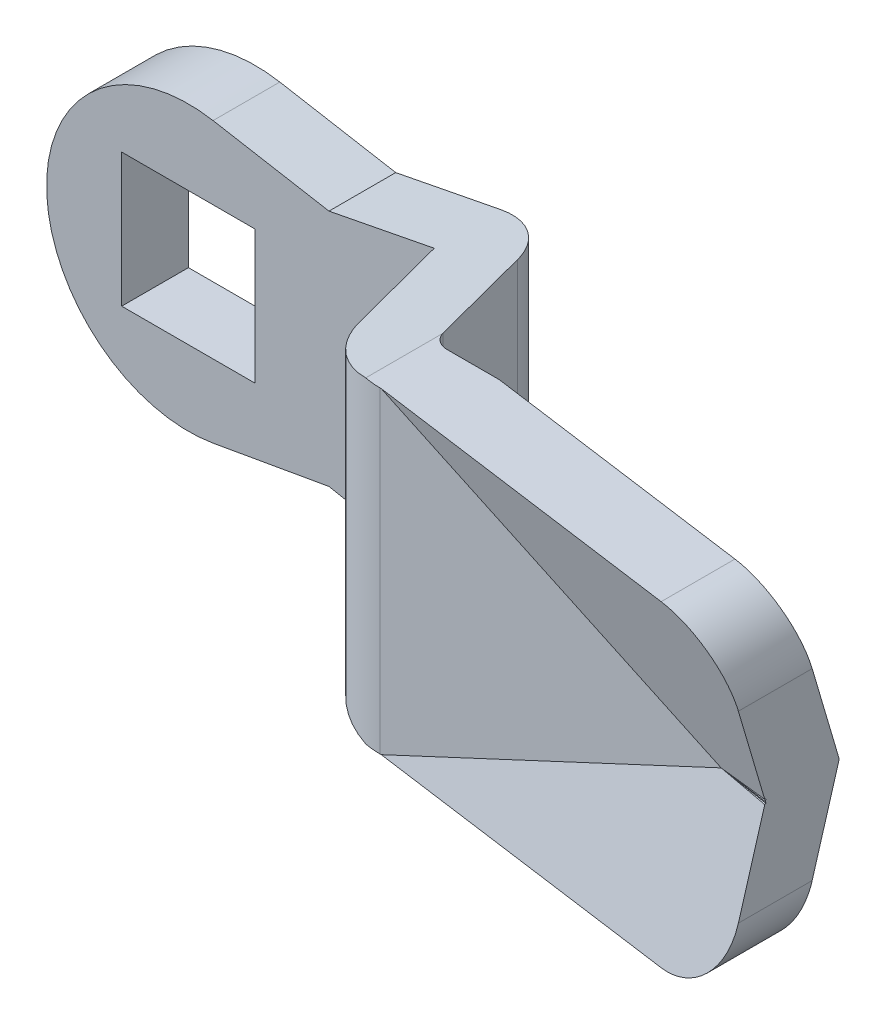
ISO-10303-21;
HEADER;
FILE_DESCRIPTION(('STEP AP214'),'2;1');
FILE_NAME('part.step','',(''),(''),'','','');
FILE_SCHEMA(('AUTOMOTIVE_DESIGN { 1 0 10303 214 1 1 1 1 }'));
ENDSEC;
DATA;
#1=APPLICATION_CONTEXT('core data for automotive mechanical design processes');
#2=APPLICATION_PROTOCOL_DEFINITION('international standard','automotive_design',2000,#1);
#3=PRODUCT_CONTEXT('',#1,'mechanical');
#4=PRODUCT('Part','Part','',(#3));
#5=PRODUCT_RELATED_PRODUCT_CATEGORY('part','',(#4));
#6=PRODUCT_DEFINITION_FORMATION('','',#4);
#7=PRODUCT_DEFINITION_CONTEXT('part definition',#1,'design');
#8=PRODUCT_DEFINITION('design','',#6,#7);
#9=PRODUCT_DEFINITION_SHAPE('','',#8);
#10=(LENGTH_UNIT() NAMED_UNIT(*) SI_UNIT(.MILLI.,.METRE.));
#11=(NAMED_UNIT(*) PLANE_ANGLE_UNIT() SI_UNIT($,.RADIAN.));
#12=(NAMED_UNIT(*) SI_UNIT($,.STERADIAN.) SOLID_ANGLE_UNIT());
#13=UNCERTAINTY_MEASURE_WITH_UNIT(LENGTH_MEASURE(1.E-05),#10,'distance_accuracy_value','');
#14=(GEOMETRIC_REPRESENTATION_CONTEXT(3) GLOBAL_UNCERTAINTY_ASSIGNED_CONTEXT((#13)) GLOBAL_UNIT_ASSIGNED_CONTEXT((#10,
#11,#12)) REPRESENTATION_CONTEXT('',''));
#15=CARTESIAN_POINT('',(0.,0.,0.));
#16=DIRECTION('',(0.,0.,1.));
#17=DIRECTION('',(1.,0.,0.));
#18=AXIS2_PLACEMENT_3D('',#15,#16,#17);
#19=CARTESIAN_POINT('',(49.9633750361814,-17.238998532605,20.1803398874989));
#20=DIRECTION('',(0.130596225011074,-0.280064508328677,-0.951056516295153));
#21=DIRECTION('',(0.,-0.959272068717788,0.28248380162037));
#22=AXIS2_PLACEMENT_3D('',#19,#20,#21);
#23=PLANE('',#22);
#24=DIRECTION('',(-0.990703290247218,0.,-0.13604040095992));
#25=VECTOR('',#24,1.);
#26=CARTESIAN_POINT('',(50.2705232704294,-9.5,17.9435575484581));
#27=LINE('',#26,#25);
#28=CARTESIAN_POINT('',(41.,-9.5,16.6705571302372));
#29=VERTEX_POINT('',#28);
#30=CARTESIAN_POINT('',(21.5518822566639,-9.5,14.));
#31=VERTEX_POINT('',#30);
#32=EDGE_CURVE('E378',#29,#31,#27,.T.);
#33=ORIENTED_EDGE('',*,*,#32,.F.);
#34=CARTESIAN_POINT('',(41.,-5.5,15.4926481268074));
#35=DIRECTION('',(0.130596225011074,-0.280064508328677,-0.951056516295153));
#36=DIRECTION('',(0.401933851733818,-0.861949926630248,0.309016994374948));
#37=AXIS2_PLACEMENT_3D('',#34,#35,#36);
#38=ELLIPSE('',#37,4.20584889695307,4.);
#39=CARTESIAN_POINT('',(45.,-5.5,16.0419161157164));
#40=VERTEX_POINT('',#39);
#41=EDGE_CURVE('E9',#29,#40,#38,.F.);
#42=ORIENTED_EDGE('',*,*,#41,.T.);
#43=DIRECTION('',(0.,0.959272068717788,-0.28248380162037));
#44=VECTOR('',#43,1.);
#45=CARTESIAN_POINT('',(45.,-17.4236857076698,19.5531703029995));
#46=LINE('',#45,#44);
#47=CARTESIAN_POINT('',(45.,-0.136162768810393,14.4623880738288));
#48=VERTEX_POINT('',#47);
#49=EDGE_CURVE('E372',#40,#48,#46,.T.);
#50=ORIENTED_EDGE('',*,*,#49,.T.);
#51=DIRECTION('',(0.987938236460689,-0.0437421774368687,0.148541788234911));
#52=VECTOR('',#51,1.);
#53=CARTESIAN_POINT('',(51.4225647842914,-0.420529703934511,15.4280549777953));
#54=LINE('',#53,#52);
#55=CARTESIAN_POINT('',(41.924698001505,0.,14.));
#56=VERTEX_POINT('',#55);
#57=EDGE_CURVE('E218',#56,#48,#54,.T.);
#58=ORIENTED_EDGE('',*,*,#57,.F.);
#59=DIRECTION('',(0.906307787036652,0.422618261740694,0.));
#60=VECTOR('',#59,1.);
#61=CARTESIAN_POINT('',(40.8120209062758,-0.518849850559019,14.));
#62=LINE('',#61,#60);
#63=EDGE_CURVE('E394',#56,#31,#62,.F.);
#64=ORIENTED_EDGE('',*,*,#63,.T.);
#65=EDGE_LOOP('',(#33,#42,#50,#58,#64));
#66=FACE_BOUND('',#65,.T.);
#67=ADVANCED_FACE('F14',(#66),#23,.F.);
#68=DIRECTION('',(-0.990703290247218,0.,-0.13604040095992));
#69=VECTOR('',#68,1.);
#70=CARTESIAN_POINT('',(50.6475627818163,0.,15.1977975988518));
#71=LINE('',#70,#69);
#72=CARTESIAN_POINT('',(45.,0.,14.4222912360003));
#73=VERTEX_POINT('',#72);
#74=EDGE_CURVE('E227',#73,#56,#71,.T.);
#75=ORIENTED_EDGE('',*,*,#74,.F.);
#76=CARTESIAN_POINT('',(45.,0.114431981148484,14.3885936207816));
#77=VERTEX_POINT('',#76);
#78=EDGE_CURVE('E234',#73,#77,#46,.T.);
#79=ORIENTED_EDGE('',*,*,#78,.T.);
#80=DIRECTION('',(0.991435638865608,0.0368913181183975,0.125277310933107));
#81=VECTOR('',#80,1.);
#82=CARTESIAN_POINT('',(41.924698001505,0.,14.));
#83=LINE('',#82,#81);
#84=EDGE_CURVE('E239',#56,#77,#83,.T.);
#85=ORIENTED_EDGE('',*,*,#84,.F.);
#86=EDGE_LOOP('',(#75,#79,#85));
#87=FACE_BOUND('',#86,.T.);
#88=ADVANCED_FACE('F536',(#87),#23,.F.);
#89=CARTESIAN_POINT('',(45.,-40.,40.));
#90=DIRECTION('',(-1.,0.,0.));
#91=DIRECTION('',(0.,1.,0.));
#92=AXIS2_PLACEMENT_3D('',#89,#90,#91);
#93=PLANE('',#92);
#94=DIRECTION('',(0.,-0.959272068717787,-0.282483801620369));
#95=VECTOR('',#94,1.);
#96=CARTESIAN_POINT('',(45.,11.3997764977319,13.3569748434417));
#97=LINE('',#96,#95);
#98=CARTESIAN_POINT('',(45.,5.5,11.6196248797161));
#99=VERTEX_POINT('',#98);
#100=CARTESIAN_POINT('',(45.,0.,10.));
#101=VERTEX_POINT('',#100);
#102=EDGE_CURVE('E374',#99,#101,#97,.T.);
#103=ORIENTED_EDGE('',*,*,#102,.F.);
#104=DIRECTION('',(0.,0.,-1.));
#105=VECTOR('',#104,1.);
#106=CARTESIAN_POINT('',(45.,5.5,40.));
#107=LINE('',#106,#105);
#108=CARTESIAN_POINT('',(45.,5.5,16.0419161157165));
#109=VERTEX_POINT('',#108);
#110=EDGE_CURVE('E458',#99,#109,#107,.F.);
#111=ORIENTED_EDGE('',*,*,#110,.T.);
#112=DIRECTION('',(0.,0.959272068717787,0.282483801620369));
#113=VECTOR('',#112,1.);
#114=CARTESIAN_POINT('',(45.,20.0272720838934,20.3198672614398));
#115=LINE('',#114,#113);
#116=CARTESIAN_POINT('',(45.,0.13616276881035,14.4623880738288));
#117=VERTEX_POINT('',#116);
#118=EDGE_CURVE('E369',#117,#109,#115,.T.);
#119=ORIENTED_EDGE('',*,*,#118,.F.);
#120=DIRECTION('',(0.,-0.28248380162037,-0.959272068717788));
#121=VECTOR('',#120,1.);
#122=CARTESIAN_POINT('',(45.,3.85356541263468,27.0861226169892));
#123=LINE('',#122,#121);
#124=EDGE_CURVE('E445',#117,#77,#123,.T.);
#125=ORIENTED_EDGE('',*,*,#124,.T.);
#126=ORIENTED_EDGE('',*,*,#78,.F.);
#127=DIRECTION('',(0.,0.959272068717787,0.28248380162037));
#128=VECTOR('',#127,1.);
#129=CARTESIAN_POINT('',(45.,-29.8770987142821,5.62416534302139));
#130=LINE('',#129,#128);
#131=CARTESIAN_POINT('',(45.,-0.114431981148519,14.3885936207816));
#132=VERTEX_POINT('',#131);
#133=EDGE_CURVE('E222',#132,#73,#130,.T.);
#134=ORIENTED_EDGE('',*,*,#133,.F.);
#135=DIRECTION('',(0.,0.282483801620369,-0.959272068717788));
#136=VECTOR('',#135,1.);
#137=CARTESIAN_POINT('',(45.,-10.2373332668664,48.7644282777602));
#138=LINE('',#137,#136);
#139=EDGE_CURVE('E212',#48,#132,#138,.T.);
#140=ORIENTED_EDGE('',*,*,#139,.F.);
#141=ORIENTED_EDGE('',*,*,#49,.F.);
#142=DIRECTION('',(0.,0.,-1.));
#143=VECTOR('',#142,1.);
#144=CARTESIAN_POINT('',(45.,-5.5,40.));
#145=LINE('',#144,#143);
#146=CARTESIAN_POINT('',(45.,-5.5,11.6196248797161));
#147=VERTEX_POINT('',#146);
#148=EDGE_CURVE('E455',#40,#147,#145,.T.);
#149=ORIENTED_EDGE('',*,*,#148,.T.);
#150=DIRECTION('',(0.,-0.959272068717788,0.28248380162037));
#151=VECTOR('',#150,1.);
#152=CARTESIAN_POINT('',(45.,-26.2800452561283,17.7388754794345));
#153=LINE('',#152,#151);
#154=EDGE_CURVE('E376',#101,#147,#153,.T.);
#155=ORIENTED_EDGE('',*,*,#154,.F.);
#156=EDGE_LOOP('',(#103,#111,#119,#125,#126,#134,#140,#141,#149,#155));
#157=FACE_BOUND('',#156,.T.);
#158=ADVANCED_FACE('F232',(#157),#93,.F.);
#159=CARTESIAN_POINT('',(41.2717168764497,1.40032254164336,18.7552825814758));
#160=DIRECTION('',(0.,0.959272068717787,-0.28248380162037));
#161=DIRECTION('',(0.,-0.28248380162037,-0.959272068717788));
#162=AXIS2_PLACEMENT_3D('',#159,#160,#161);
#163=PLANE('',#162);
#164=DIRECTION('',(0.987938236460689,0.0437421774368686,0.148541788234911));
#165=VECTOR('',#164,1.);
#166=CARTESIAN_POINT('',(42.0457266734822,0.00535869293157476,14.018197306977));
#167=LINE('',#166,#165);
#168=EDGE_CURVE('E447',#56,#117,#167,.T.);
#169=ORIENTED_EDGE('',*,*,#168,.F.);
#170=ORIENTED_EDGE('',*,*,#84,.T.);
#171=ORIENTED_EDGE('',*,*,#124,.F.);
#172=EDGE_LOOP('',(#169,#170,#171));
#173=FACE_BOUND('',#172,.T.);
#174=ADVANCED_FACE('F534',(#173),#163,.F.);
#175=CARTESIAN_POINT('',(10.5,-2.8,-2.4));
#176=DIRECTION('',(1.,0.,0.));
#177=DIRECTION('',(0.,0.,1.));
#178=AXIS2_PLACEMENT_3D('',#175,#176,#177);
#179=PLANE('',#178);
#180=DIRECTION('',(0.,0.,1.));
#181=VECTOR('',#180,1.);
#182=CARTESIAN_POINT('',(10.5,-2.8,-2.4));
#183=LINE('',#182,#181);
#184=CARTESIAN_POINT('',(10.5,-2.8,-0.400000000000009));
#185=VERTEX_POINT('',#184);
#186=CARTESIAN_POINT('',(10.5,-2.8,0.));
#187=VERTEX_POINT('',#186);
#188=EDGE_CURVE('E279',#185,#187,#183,.T.);
#189=ORIENTED_EDGE('',*,*,#188,.F.);
#190=DIRECTION('',(0.,-1.,0.));
#191=VECTOR('',#190,1.);
#192=CARTESIAN_POINT('',(10.5,9.5,-0.400000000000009));
#193=LINE('',#192,#191);
#194=CARTESIAN_POINT('',(10.5,2.8,-0.400000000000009));
#195=VERTEX_POINT('',#194);
#196=EDGE_CURVE('E245',#195,#185,#193,.T.);
#197=ORIENTED_EDGE('',*,*,#196,.F.);
#198=DIRECTION('',(0.,0.,1.));
#199=VECTOR('',#198,1.);
#200=CARTESIAN_POINT('',(10.5,2.8,-2.4));
#201=LINE('',#200,#199);
#202=CARTESIAN_POINT('',(10.5,2.8,0.));
#203=VERTEX_POINT('',#202);
#204=EDGE_CURVE('E271',#195,#203,#201,.T.);
#205=ORIENTED_EDGE('',*,*,#204,.T.);
#206=DIRECTION('',(0.,1.,0.));
#207=VECTOR('',#206,1.);
#208=CARTESIAN_POINT('',(10.5,-2.8,0.));
#209=LINE('',#208,#207);
#210=EDGE_CURVE('E252',#187,#203,#209,.T.);
#211=ORIENTED_EDGE('',*,*,#210,.F.);
#212=EDGE_LOOP('',(#189,#197,#205,#211));
#213=FACE_BOUND('',#212,.T.);
#214=ADVANCED_FACE('F795',(#213),#179,.T.);
#215=CARTESIAN_POINT('',(10.5,-2.8,-2.4));
#216=DIRECTION('',(0.,1.,0.));
#217=DIRECTION('',(1.,0.,0.));
#218=AXIS2_PLACEMENT_3D('',#215,#216,#217);
#219=PLANE('',#218);
#220=DIRECTION('',(0.707106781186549,0.,0.707106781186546));
#221=VECTOR('',#220,1.);
#222=CARTESIAN_POINT('',(8.5,-2.8,-2.4));
#223=LINE('',#222,#221);
#224=CARTESIAN_POINT('',(8.5,-2.8,-2.4));
#225=VERTEX_POINT('',#224);
#226=EDGE_CURVE('E242',#225,#185,#223,.T.);
#227=ORIENTED_EDGE('',*,*,#226,.T.);
#228=ORIENTED_EDGE('',*,*,#188,.T.);
#229=DIRECTION('',(-1.,0.,0.));
#230=VECTOR('',#229,1.);
#231=CARTESIAN_POINT('',(10.5,-2.8,0.));
#232=LINE('',#231,#230);
#233=CARTESIAN_POINT('',(6.5,-2.8,0.));
#234=VERTEX_POINT('',#233);
#235=EDGE_CURVE('E260',#187,#234,#232,.T.);
#236=ORIENTED_EDGE('',*,*,#235,.T.);
#237=DIRECTION('',(0.,0.,1.));
#238=VECTOR('',#237,1.);
#239=CARTESIAN_POINT('',(6.5,-2.8,-2.4));
#240=LINE('',#239,#238);
#241=CARTESIAN_POINT('',(6.5,-2.8,-2.4));
#242=VERTEX_POINT('',#241);
#243=EDGE_CURVE('E276',#242,#234,#240,.T.);
#244=ORIENTED_EDGE('',*,*,#243,.F.);
#245=DIRECTION('',(-1.,0.,0.));
#246=VECTOR('',#245,1.);
#247=CARTESIAN_POINT('',(10.5,-2.8,-2.4));
#248=LINE('',#247,#246);
#249=EDGE_CURVE('E269',#225,#242,#248,.T.);
#250=ORIENTED_EDGE('',*,*,#249,.F.);
#251=EDGE_LOOP('',(#227,#228,#236,#244,#250));
#252=FACE_BOUND('',#251,.T.);
#253=ADVANCED_FACE('F785',(#252),#219,.F.);
#254=CARTESIAN_POINT('',(6.5,2.8,-2.4));
#255=DIRECTION('',(0.,-1.,0.));
#256=DIRECTION('',(-1.,0.,0.));
#257=AXIS2_PLACEMENT_3D('',#254,#255,#256);
#258=PLANE('',#257);
#259=DIRECTION('',(0.707106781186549,0.,0.707106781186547));
#260=VECTOR('',#259,1.);
#261=CARTESIAN_POINT('',(7.5,2.8,-3.4));
#262=LINE('',#261,#260);
#263=CARTESIAN_POINT('',(8.5,2.8,-2.4));
#264=VERTEX_POINT('',#263);
#265=EDGE_CURVE('E250',#264,#195,#262,.T.);
#266=ORIENTED_EDGE('',*,*,#265,.F.);
#267=DIRECTION('',(1.,0.,0.));
#268=VECTOR('',#267,1.);
#269=CARTESIAN_POINT('',(6.5,2.8,-2.4));
#270=LINE('',#269,#268);
#271=CARTESIAN_POINT('',(6.5,2.8,-2.4));
#272=VERTEX_POINT('',#271);
#273=EDGE_CURVE('E263',#272,#264,#270,.T.);
#274=ORIENTED_EDGE('',*,*,#273,.F.);
#275=DIRECTION('',(0.,0.,1.));
#276=VECTOR('',#275,1.);
#277=CARTESIAN_POINT('',(6.5,2.8,-2.4));
#278=LINE('',#277,#276);
#279=CARTESIAN_POINT('',(6.5,2.8,0.));
#280=VERTEX_POINT('',#279);
#281=EDGE_CURVE('E273',#272,#280,#278,.T.);
#282=ORIENTED_EDGE('',*,*,#281,.T.);
#283=DIRECTION('',(1.,0.,0.));
#284=VECTOR('',#283,1.);
#285=CARTESIAN_POINT('',(6.5,2.8,0.));
#286=LINE('',#285,#284);
#287=EDGE_CURVE('E255',#280,#203,#286,.T.);
#288=ORIENTED_EDGE('',*,*,#287,.T.);
#289=ORIENTED_EDGE('',*,*,#204,.F.);
#290=EDGE_LOOP('',(#266,#274,#282,#288,#289));
#291=FACE_BOUND('',#290,.T.);
#292=ADVANCED_FACE('F774',(#291),#258,.F.);
#293=CARTESIAN_POINT('',(10.5,2.8,-2.4));
#294=DIRECTION('',(0.,0.,-1.));
#295=DIRECTION('',(1.,0.,0.));
#296=AXIS2_PLACEMENT_3D('',#293,#294,#295);
#297=PLANE('',#296);
#298=ORIENTED_EDGE('',*,*,#273,.T.);
#299=DIRECTION('',(0.,-1.,0.));
#300=VECTOR('',#299,1.);
#301=CARTESIAN_POINT('',(8.5,9.5,-2.4));
#302=LINE('',#301,#300);
#303=EDGE_CURVE('E247',#264,#225,#302,.T.);
#304=ORIENTED_EDGE('',*,*,#303,.T.);
#305=ORIENTED_EDGE('',*,*,#249,.T.);
#306=DIRECTION('',(0.,-1.,0.));
#307=VECTOR('',#306,1.);
#308=CARTESIAN_POINT('',(6.5,2.8,-2.4));
#309=LINE('',#308,#307);
#310=EDGE_CURVE('E266',#272,#242,#309,.T.);
#311=ORIENTED_EDGE('',*,*,#310,.F.);
#312=EDGE_LOOP('',(#298,#304,#305,#311));
#313=FACE_BOUND('',#312,.T.);
#314=ADVANCED_FACE('F565',(#313),#297,.T.);
#315=CARTESIAN_POINT('',(14.7328488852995,-9.5,0.));
#316=DIRECTION('',(0.,0.,-1.));
#317=DIRECTION('',(1.,0.,0.));
#318=AXIS2_PLACEMENT_3D('',#315,#316,#317);
#319=PLANE('',#318);
#320=DIRECTION('',(0.,1.,0.));
#321=VECTOR('',#320,1.);
#322=CARTESIAN_POINT('',(14.7328488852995,-9.5,0.));
#323=LINE('',#322,#321);
#324=CARTESIAN_POINT('',(14.7328488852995,-8.37243725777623,0.));
#325=VERTEX_POINT('',#324);
#326=CARTESIAN_POINT('',(14.7328488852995,8.37243725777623,0.));
#327=VERTEX_POINT('',#326);
#328=EDGE_CURVE('E426',#325,#327,#323,.T.);
#329=ORIENTED_EDGE('',*,*,#328,.F.);
#330=DIRECTION('',(-0.981627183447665,0.190808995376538,0.));
#331=VECTOR('',#330,1.);
#332=CARTESIAN_POINT('',(14.944045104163,-8.41348964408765,0.));
#333=LINE('',#332,#331);
#334=CARTESIAN_POINT('',(8.42299234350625,-7.14592539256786,0.));
#335=VERTEX_POINT('',#334);
#336=EDGE_CURVE('E319',#325,#335,#333,.T.);
#337=ORIENTED_EDGE('',*,*,#336,.T.);
#338=DIRECTION('',(0.984807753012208,0.173648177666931,0.));
#339=VECTOR('',#338,1.);
#340=CARTESIAN_POINT('',(14.1400129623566,-6.13786040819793,0.));
#341=LINE('',#340,#339);
#342=CARTESIAN_POINT('',(1.47600951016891,-8.37086590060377,0.));
#343=VERTEX_POINT('',#342);
#344=EDGE_CURVE('E443',#343,#335,#341,.T.);
#345=ORIENTED_EDGE('',*,*,#344,.F.);
#346=CARTESIAN_POINT('',(0.,0.,0.));
#347=DIRECTION('',(0.,0.,-1.));
#348=DIRECTION('',(1.,0.,0.));
#349=AXIS2_PLACEMENT_3D('',#346,#347,#348);
#350=CIRCLE('',#349,8.5);
#351=CARTESIAN_POINT('',(1.47600951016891,8.37086590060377,0.));
#352=VERTEX_POINT('',#351);
#353=EDGE_CURVE('E328',#343,#352,#350,.T.);
#354=ORIENTED_EDGE('',*,*,#353,.T.);
#355=DIRECTION('',(0.984807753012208,-0.173648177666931,0.));
#356=VECTOR('',#355,1.);
#357=CARTESIAN_POINT('',(17.3892043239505,5.56494030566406,0.));
#358=LINE('',#357,#356);
#359=CARTESIAN_POINT('',(8.42299234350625,7.14592539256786,0.));
#360=VERTEX_POINT('',#359);
#361=EDGE_CURVE('E440',#352,#360,#358,.T.);
#362=ORIENTED_EDGE('',*,*,#361,.T.);
#363=DIRECTION('',(-0.981627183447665,-0.190808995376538,0.));
#364=VECTOR('',#363,1.);
#365=CARTESIAN_POINT('',(11.385282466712,7.72173626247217,0.));
#366=LINE('',#365,#364);
#367=EDGE_CURVE('E302',#327,#360,#366,.T.);
#368=ORIENTED_EDGE('',*,*,#367,.F.);
#369=EDGE_LOOP('',(#329,#337,#345,#354,#362,#368));
#370=FACE_BOUND('',#369,.T.);
#371=DIRECTION('',(1.,0.,0.));
#372=VECTOR('',#371,1.);
#373=CARTESIAN_POINT('',(-4.,4.,0.));
#374=LINE('',#373,#372);
#375=CARTESIAN_POINT('',(-4.,4.,0.));
#376=VERTEX_POINT('',#375);
#377=CARTESIAN_POINT('',(4.,4.,0.));
#378=VERTEX_POINT('',#377);
#379=EDGE_CURVE('E346',#376,#378,#374,.T.);
#380=ORIENTED_EDGE('',*,*,#379,.F.);
#381=DIRECTION('',(0.,-1.,0.));
#382=VECTOR('',#381,1.);
#383=CARTESIAN_POINT('',(-4.,4.,0.));
#384=LINE('',#383,#382);
#385=CARTESIAN_POINT('',(-4.,-4.,0.));
#386=VERTEX_POINT('',#385);
#387=EDGE_CURVE('E337',#376,#386,#384,.T.);
#388=ORIENTED_EDGE('',*,*,#387,.T.);
#389=DIRECTION('',(-1.,0.,0.));
#390=VECTOR('',#389,1.);
#391=CARTESIAN_POINT('',(4.,-4.,0.));
#392=LINE('',#391,#390);
#393=CARTESIAN_POINT('',(4.,-4.,0.));
#394=VERTEX_POINT('',#393);
#395=EDGE_CURVE('E340',#394,#386,#392,.T.);
#396=ORIENTED_EDGE('',*,*,#395,.F.);
#397=DIRECTION('',(0.,1.,0.));
#398=VECTOR('',#397,1.);
#399=CARTESIAN_POINT('',(4.,-4.,0.));
#400=LINE('',#399,#398);
#401=EDGE_CURVE('E343',#394,#378,#400,.T.);
#402=ORIENTED_EDGE('',*,*,#401,.T.);
#403=EDGE_LOOP('',(#380,#388,#396,#402));
#404=FACE_BOUND('',#403,.T.);
#405=ORIENTED_EDGE('',*,*,#235,.F.);
#406=ORIENTED_EDGE('',*,*,#210,.T.);
#407=ORIENTED_EDGE('',*,*,#287,.F.);
#408=DIRECTION('',(0.,-1.,0.));
#409=VECTOR('',#408,1.);
#410=CARTESIAN_POINT('',(6.5,2.8,0.));
#411=LINE('',#410,#409);
#412=EDGE_CURVE('E258',#280,#234,#411,.T.);
#413=ORIENTED_EDGE('',*,*,#412,.T.);
#414=EDGE_LOOP('',(#405,#406,#407,#413));
#415=FACE_BOUND('',#414,.T.);
#416=ADVANCED_FACE('F505',(#370,#404,#415),#319,.T.);
#417=CARTESIAN_POINT('',(14.7328488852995,-9.5,4.));
#418=DIRECTION('',(0.,0.,-1.));
#419=DIRECTION('',(1.,0.,0.));
#420=AXIS2_PLACEMENT_3D('',#417,#418,#419);
#421=PLANE('',#420);
#422=DIRECTION('',(0.,-1.,0.));
#423=VECTOR('',#422,1.);
#424=CARTESIAN_POINT('',(-4.,-9.5,4.));
#425=LINE('',#424,#423);
#426=CARTESIAN_POINT('',(-4.,4.,4.));
#427=VERTEX_POINT('',#426);
#428=CARTESIAN_POINT('',(-4.,-4.,4.));
#429=VERTEX_POINT('',#428);
#430=EDGE_CURVE('E367',#427,#429,#425,.T.);
#431=ORIENTED_EDGE('',*,*,#430,.F.);
#432=DIRECTION('',(1.,0.,0.));
#433=VECTOR('',#432,1.);
#434=CARTESIAN_POINT('',(14.7328488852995,4.,4.));
#435=LINE('',#434,#433);
#436=CARTESIAN_POINT('',(4.,4.,4.));
#437=VERTEX_POINT('',#436);
#438=EDGE_CURVE('E358',#427,#437,#435,.T.);
#439=ORIENTED_EDGE('',*,*,#438,.T.);
#440=DIRECTION('',(0.,1.,0.));
#441=VECTOR('',#440,1.);
#442=CARTESIAN_POINT('',(4.,-9.5,4.));
#443=LINE('',#442,#441);
#444=CARTESIAN_POINT('',(4.,-4.,4.));
#445=VERTEX_POINT('',#444);
#446=EDGE_CURVE('E361',#445,#437,#443,.T.);
#447=ORIENTED_EDGE('',*,*,#446,.F.);
#448=DIRECTION('',(-1.,0.,0.));
#449=VECTOR('',#448,1.);
#450=CARTESIAN_POINT('',(14.7328488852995,-4.,4.));
#451=LINE('',#450,#449);
#452=EDGE_CURVE('E364',#445,#429,#451,.T.);
#453=ORIENTED_EDGE('',*,*,#452,.T.);
#454=EDGE_LOOP('',(#431,#439,#447,#453));
#455=FACE_BOUND('',#454,.T.);
#456=DIRECTION('',(-0.981627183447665,0.190808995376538,0.));
#457=VECTOR('',#456,1.);
#458=CARTESIAN_POINT('',(14.944045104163,-8.41348964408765,4.));
#459=LINE('',#458,#457);
#460=CARTESIAN_POINT('',(14.7328488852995,-8.37243725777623,4.));
#461=VERTEX_POINT('',#460);
#462=CARTESIAN_POINT('',(8.42299234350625,-7.14592539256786,4.));
#463=VERTEX_POINT('',#462);
#464=EDGE_CURVE('E326',#461,#463,#459,.T.);
#465=ORIENTED_EDGE('',*,*,#464,.F.);
#466=DIRECTION('',(0.,1.,0.));
#467=VECTOR('',#466,1.);
#468=CARTESIAN_POINT('',(14.7328488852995,-9.5,4.));
#469=LINE('',#468,#467);
#470=CARTESIAN_POINT('',(14.7328488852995,8.37243725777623,4.));
#471=VERTEX_POINT('',#470);
#472=EDGE_CURVE('E429',#461,#471,#469,.T.);
#473=ORIENTED_EDGE('',*,*,#472,.T.);
#474=DIRECTION('',(-0.981627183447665,-0.190808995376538,0.));
#475=VECTOR('',#474,1.);
#476=CARTESIAN_POINT('',(11.385282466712,7.72173626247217,4.));
#477=LINE('',#476,#475);
#478=CARTESIAN_POINT('',(8.42299234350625,7.14592539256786,4.));
#479=VERTEX_POINT('',#478);
#480=EDGE_CURVE('E310',#471,#479,#477,.T.);
#481=ORIENTED_EDGE('',*,*,#480,.T.);
#482=DIRECTION('',(0.984807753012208,-0.173648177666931,0.));
#483=VECTOR('',#482,1.);
#484=CARTESIAN_POINT('',(17.3892043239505,5.56494030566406,4.));
#485=LINE('',#484,#483);
#486=CARTESIAN_POINT('',(1.47600951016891,8.37086590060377,4.));
#487=VERTEX_POINT('',#486);
#488=EDGE_CURVE('E332',#487,#479,#485,.T.);
#489=ORIENTED_EDGE('',*,*,#488,.F.);
#490=CARTESIAN_POINT('',(0.,0.,4.));
#491=DIRECTION('',(0.,0.,-1.));
#492=DIRECTION('',(1.,0.,0.));
#493=AXIS2_PLACEMENT_3D('',#490,#491,#492);
#494=CIRCLE('',#493,8.5);
#495=CARTESIAN_POINT('',(1.47600951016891,-8.37086590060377,4.));
#496=VERTEX_POINT('',#495);
#497=EDGE_CURVE('E330',#496,#487,#494,.T.);
#498=ORIENTED_EDGE('',*,*,#497,.F.);
#499=DIRECTION('',(0.984807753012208,0.173648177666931,0.));
#500=VECTOR('',#499,1.);
#501=CARTESIAN_POINT('',(14.1400129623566,-6.13786040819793,4.));
#502=LINE('',#501,#500);
#503=EDGE_CURVE('E334',#496,#463,#502,.T.);
#504=ORIENTED_EDGE('',*,*,#503,.T.);
#505=EDGE_LOOP('',(#465,#473,#481,#489,#498,#504));
#506=FACE_BOUND('',#505,.T.);
#507=ADVANCED_FACE('F517',(#455,#506),#421,.F.);
#508=CARTESIAN_POINT('',(21.4899610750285,-9.5,9.));
#509=DIRECTION('',(0.,-1.,0.));
#510=DIRECTION('',(-1.,0.,0.));
#511=AXIS2_PLACEMENT_3D('',#508,#509,#510);
#512=PLANE('',#511);
#513=DIRECTION('',(0.990703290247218,0.,0.13604040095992));
#514=VECTOR('',#513,1.);
#515=CARTESIAN_POINT('',(33.3500490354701,-9.5,11.1977975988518));
#516=LINE('',#515,#514);
#517=CARTESIAN_POINT('',(24.6271842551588,-9.5,10.));
#518=VERTEX_POINT('',#517);
#519=CARTESIAN_POINT('',(41.,-9.5,12.2482658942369));
#520=VERTEX_POINT('',#519);
#521=EDGE_CURVE('E438',#518,#520,#516,.T.);
#522=ORIENTED_EDGE('',*,*,#521,.T.);
#523=DIRECTION('',(0.,0.,-1.));
#524=VECTOR('',#523,1.);
#525=CARTESIAN_POINT('',(41.,-9.5,40.));
#526=LINE('',#525,#524);
#527=EDGE_CURVE('E22',#520,#29,#526,.F.);
#528=ORIENTED_EDGE('',*,*,#527,.T.);
#529=ORIENTED_EDGE('',*,*,#32,.T.);
#530=DIRECTION('',(-1.,0.,0.));
#531=VECTOR('',#530,1.);
#532=CARTESIAN_POINT('',(45.,-9.5,14.));
#533=LINE('',#532,#531);
#534=CARTESIAN_POINT('',(21.4899610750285,-9.5,14.));
#535=VERTEX_POINT('',#534);
#536=EDGE_CURVE('E415',#31,#535,#533,.T.);
#537=ORIENTED_EDGE('',*,*,#536,.T.);
#538=CARTESIAN_POINT('',(21.4899610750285,-9.5,9.));
#539=DIRECTION('',(0.,-1.,0.));
#540=DIRECTION('',(-1.,0.,0.));
#541=AXIS2_PLACEMENT_3D('',#538,#539,#540);
#542=CIRCLE('',#541,5.);
#543=CARTESIAN_POINT('',(20.5336563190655,-9.5,13.90769612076));
#544=VERTEX_POINT('',#543);
#545=EDGE_CURVE('E412',#535,#544,#542,.T.);
#546=ORIENTED_EDGE('',*,*,#545,.T.);
#547=DIRECTION('',(0.,0.,-1.));
#548=VECTOR('',#547,1.);
#549=CARTESIAN_POINT('',(20.5336563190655,-9.5,25.));
#550=LINE('',#549,#548);
#551=CARTESIAN_POINT('',(20.5336563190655,-9.5,9.29237170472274));
#552=VERTEX_POINT('',#551);
#553=EDGE_CURVE('E295',#544,#552,#550,.T.);
#554=ORIENTED_EDGE('',*,*,#553,.T.);
#555=CARTESIAN_POINT('',(21.4899610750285,-9.5,9.));
#556=DIRECTION('',(0.,-1.,0.));
#557=DIRECTION('',(-1.,0.,0.));
#558=AXIS2_PLACEMENT_3D('',#555,#556,#557);
#559=CIRCLE('',#558,1.);
#560=CARTESIAN_POINT('',(21.4899610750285,-9.5,10.));
#561=VERTEX_POINT('',#560);
#562=EDGE_CURVE('E409',#561,#552,#559,.T.);
#563=ORIENTED_EDGE('',*,*,#562,.F.);
#564=DIRECTION('',(-1.,0.,0.));
#565=VECTOR('',#564,1.);
#566=CARTESIAN_POINT('',(45.,-9.5,10.));
#567=LINE('',#566,#565);
#568=EDGE_CURVE('E407',#518,#561,#567,.T.);
#569=ORIENTED_EDGE('',*,*,#568,.F.);
#570=EDGE_LOOP('',(#522,#528,#529,#537,#546,#554,#563,#569));
#571=FACE_BOUND('',#570,.T.);
#572=ADVANCED_FACE('F552',(#571),#512,.T.);
#573=CARTESIAN_POINT('',(21.4899610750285,-9.5,9.));
#574=DIRECTION('',(0.,1.,0.));
#575=DIRECTION('',(1.,0.,0.));
#576=AXIS2_PLACEMENT_3D('',#573,#574,#575);
#577=CYLINDRICAL_SURFACE('',#576,5.);
#578=CARTESIAN_POINT('',(21.4899610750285,-9.68588681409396,9.));
#579=DIRECTION('',(-0.190808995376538,-0.981627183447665,0.));
#580=DIRECTION('',(-0.981627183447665,0.190808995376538,0.));
#581=AXIS2_PLACEMENT_3D('',#578,#579,#580);
#582=ELLIPSE('',#581,5.09358347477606,5.);
#583=CARTESIAN_POINT('',(16.7084372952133,-8.75645274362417,10.4618585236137));
#584=VERTEX_POINT('',#583);
#585=EDGE_CURVE('E324',#544,#584,#582,.T.);
#586=ORIENTED_EDGE('',*,*,#585,.F.);
#587=ORIENTED_EDGE('',*,*,#545,.F.);
#588=DIRECTION('',(0.,1.,0.));
#589=VECTOR('',#588,1.);
#590=CARTESIAN_POINT('',(21.4899610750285,-9.5,14.));
#591=LINE('',#590,#589);
#592=CARTESIAN_POINT('',(21.4899610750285,9.5,14.));
#593=VERTEX_POINT('',#592);
#594=EDGE_CURVE('E435',#535,#593,#591,.T.);
#595=ORIENTED_EDGE('',*,*,#594,.T.);
#596=CARTESIAN_POINT('',(21.4899610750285,9.5,9.));
#597=DIRECTION('',(0.,-1.,0.));
#598=DIRECTION('',(-1.,0.,0.));
#599=AXIS2_PLACEMENT_3D('',#596,#597,#598);
#600=CIRCLE('',#599,5.);
#601=CARTESIAN_POINT('',(20.5336563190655,9.5,13.90769612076));
#602=VERTEX_POINT('',#601);
#603=EDGE_CURVE('E402',#593,#602,#600,.T.);
#604=ORIENTED_EDGE('',*,*,#603,.T.);
#605=CARTESIAN_POINT('',(21.4899610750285,9.68588681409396,9.));
#606=DIRECTION('',(0.190808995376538,-0.981627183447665,0.));
#607=DIRECTION('',(0.981627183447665,0.190808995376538,0.));
#608=AXIS2_PLACEMENT_3D('',#605,#606,#607);
#609=ELLIPSE('',#608,5.09358347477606,5.);
#610=CARTESIAN_POINT('',(16.7084372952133,8.75645274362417,10.4618585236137));
#611=VERTEX_POINT('',#610);
#612=EDGE_CURVE('E307',#602,#611,#609,.T.);
#613=ORIENTED_EDGE('',*,*,#612,.T.);
#614=DIRECTION('',(0.,1.,0.));
#615=VECTOR('',#614,1.);
#616=CARTESIAN_POINT('',(16.7084372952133,-9.5,10.4618585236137));
#617=LINE('',#616,#615);
#618=EDGE_CURVE('E432',#584,#611,#617,.T.);
#619=ORIENTED_EDGE('',*,*,#618,.F.);
#620=EDGE_LOOP('',(#586,#587,#595,#604,#613,#619));
#621=FACE_BOUND('',#620,.T.);
#622=ADVANCED_FACE('F525',(#621),#577,.T.);
#623=CARTESIAN_POINT('',(16.7084372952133,-9.5,10.4618585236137));
#624=DIRECTION('',(0.956304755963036,0.,-0.292371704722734));
#625=DIRECTION('',(0.292371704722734,0.,0.956304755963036));
#626=AXIS2_PLACEMENT_3D('',#623,#624,#625);
#627=PLANE('',#626);
#628=DIRECTION('',(-0.291900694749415,0.0567397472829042,-0.954764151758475));
#629=VECTOR('',#628,1.);
#630=CARTESIAN_POINT('',(16.7207522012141,-8.7588465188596,10.5021387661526));
#631=LINE('',#630,#629);
#632=EDGE_CURVE('E322',#584,#461,#631,.T.);
#633=ORIENTED_EDGE('',*,*,#632,.F.);
#634=ORIENTED_EDGE('',*,*,#618,.T.);
#635=DIRECTION('',(-0.291900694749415,-0.0567397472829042,-0.954764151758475));
#636=VECTOR('',#635,1.);
#637=CARTESIAN_POINT('',(16.4060671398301,8.69767793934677,9.47285030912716));
#638=LINE('',#637,#636);
#639=EDGE_CURVE('E304',#611,#471,#638,.T.);
#640=ORIENTED_EDGE('',*,*,#639,.T.);
#641=ORIENTED_EDGE('',*,*,#472,.F.);
#642=EDGE_LOOP('',(#633,#634,#640,#641));
#643=FACE_BOUND('',#642,.T.);
#644=ADVANCED_FACE('F521',(#643),#627,.F.);
#645=CARTESIAN_POINT('',(14.7328488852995,-9.5,4.));
#646=DIRECTION('',(0.,1.,0.));
#647=DIRECTION('',(1.,0.,0.));
#648=AXIS2_PLACEMENT_3D('',#645,#646,#647);
#649=CYLINDRICAL_SURFACE('',#648,4.);
#650=DIRECTION('',(0.,1.,0.));
#651=VECTOR('',#650,1.);
#652=CARTESIAN_POINT('',(18.5580679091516,-9.5,2.83051318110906));
#653=LINE('',#652,#651);
#654=CARTESIAN_POINT('',(18.5580679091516,-9.11598451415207,2.83051318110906));
#655=VERTEX_POINT('',#654);
#656=CARTESIAN_POINT('',(18.5580679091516,9.11598451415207,2.83051318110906));
#657=VERTEX_POINT('',#656);
#658=EDGE_CURVE('E423',#655,#657,#653,.T.);
#659=ORIENTED_EDGE('',*,*,#658,.F.);
#660=CARTESIAN_POINT('',(14.7328488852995,-8.37243725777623,4.));
#661=DIRECTION('',(-0.190808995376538,-0.981627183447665,0.));
#662=DIRECTION('',(-0.981627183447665,0.190808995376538,0.));
#663=AXIS2_PLACEMENT_3D('',#660,#661,#662);
#664=ELLIPSE('',#663,4.07486677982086,4.);
#665=EDGE_CURVE('E316',#655,#325,#664,.F.);
#666=ORIENTED_EDGE('',*,*,#665,.T.);
#667=ORIENTED_EDGE('',*,*,#328,.T.);
#668=CARTESIAN_POINT('',(14.7328488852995,8.37243725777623,4.));
#669=DIRECTION('',(0.190808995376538,-0.981627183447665,0.));
#670=DIRECTION('',(0.981627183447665,0.190808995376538,0.));
#671=AXIS2_PLACEMENT_3D('',#668,#669,#670);
#672=ELLIPSE('',#671,4.07486677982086,4.);
#673=EDGE_CURVE('E300',#657,#327,#672,.F.);
#674=ORIENTED_EDGE('',*,*,#673,.F.);
#675=EDGE_LOOP('',(#659,#666,#667,#674));
#676=FACE_BOUND('',#675,.T.);
#677=ADVANCED_FACE('F502',(#676),#649,.T.);
#678=CARTESIAN_POINT('',(20.5336563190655,-9.5,9.29237170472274));
#679=DIRECTION('',(0.956304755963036,0.,-0.292371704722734));
#680=DIRECTION('',(0.292371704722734,0.,0.956304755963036));
#681=AXIS2_PLACEMENT_3D('',#678,#679,#680);
#682=PLANE('',#681);
#683=DIRECTION('',(0.,1.,0.));
#684=VECTOR('',#683,1.);
#685=CARTESIAN_POINT('',(20.5336563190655,-9.5,9.29237170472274));
#686=LINE('',#685,#684);
#687=CARTESIAN_POINT('',(20.5336563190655,9.5,9.29237170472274));
#688=VERTEX_POINT('',#687);
#689=EDGE_CURVE('E420',#552,#688,#686,.T.);
#690=ORIENTED_EDGE('',*,*,#689,.F.);
#691=DIRECTION('',(-0.291900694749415,0.0567397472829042,-0.954764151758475));
#692=VECTOR('',#691,1.);
#693=CARTESIAN_POINT('',(20.5336563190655,-9.5,9.29237170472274));
#694=LINE('',#693,#692);
#695=EDGE_CURVE('E313',#552,#655,#694,.T.);
#696=ORIENTED_EDGE('',*,*,#695,.T.);
#697=ORIENTED_EDGE('',*,*,#658,.T.);
#698=DIRECTION('',(-0.291900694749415,-0.0567397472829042,-0.954764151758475));
#699=VECTOR('',#698,1.);
#700=CARTESIAN_POINT('',(20.2189712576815,9.43883142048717,8.26308324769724));
#701=LINE('',#700,#699);
#702=EDGE_CURVE('E298',#688,#657,#701,.T.);
#703=ORIENTED_EDGE('',*,*,#702,.F.);
#704=EDGE_LOOP('',(#690,#696,#697,#703));
#705=FACE_BOUND('',#704,.T.);
#706=ADVANCED_FACE('F495',(#705),#682,.T.);
#707=CARTESIAN_POINT('',(32.6658612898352,-26.738998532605,16.1803398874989));
#708=DIRECTION('',(-0.130596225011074,0.280064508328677,0.951056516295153));
#709=DIRECTION('',(0.,0.959272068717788,-0.28248380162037));
#710=AXIS2_PLACEMENT_3D('',#707,#708,#709);
#711=PLANE('',#710);
#712=ORIENTED_EDGE('',*,*,#154,.T.);
#713=CARTESIAN_POINT('',(41.,-5.5,11.070356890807));
#714=DIRECTION('',(-0.130596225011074,0.280064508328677,0.951056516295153));
#715=DIRECTION('',(0.401933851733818,-0.861949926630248,0.309016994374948));
#716=AXIS2_PLACEMENT_3D('',#713,#714,#715);
#717=ELLIPSE('',#716,4.20584889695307,4.);
#718=EDGE_CURVE('E36',#147,#520,#717,.F.);
#719=ORIENTED_EDGE('',*,*,#718,.T.);
#720=ORIENTED_EDGE('',*,*,#521,.F.);
#721=DIRECTION('',(-0.906307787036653,-0.422618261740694,0.));
#722=VECTOR('',#721,1.);
#723=CARTESIAN_POINT('',(45.,0.,10.));
#724=LINE('',#723,#722);
#725=EDGE_CURVE('E388',#101,#518,#724,.T.);
#726=ORIENTED_EDGE('',*,*,#725,.F.);
#727=EDGE_LOOP('',(#712,#719,#720,#726));
#728=FACE_BOUND('',#727,.T.);
#729=ADVANCED_FACE('F481',(#728),#711,.F.);
#730=CARTESIAN_POINT('',(45.,-9.5,10.));
#731=DIRECTION('',(0.,0.,-1.));
#732=DIRECTION('',(0.,-1.,0.));
#733=AXIS2_PLACEMENT_3D('',#730,#731,#732);
#734=PLANE('',#733);
#735=DIRECTION('',(-0.906307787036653,0.422618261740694,0.));
#736=VECTOR('',#735,1.);
#737=CARTESIAN_POINT('',(45.,0.,10.));
#738=LINE('',#737,#736);
#739=CARTESIAN_POINT('',(24.6271842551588,9.5,10.));
#740=VERTEX_POINT('',#739);
#741=EDGE_CURVE('E385',#101,#740,#738,.T.);
#742=ORIENTED_EDGE('',*,*,#741,.F.);
#743=ORIENTED_EDGE('',*,*,#725,.T.);
#744=ORIENTED_EDGE('',*,*,#568,.T.);
#745=DIRECTION('',(0.,1.,0.));
#746=VECTOR('',#745,1.);
#747=CARTESIAN_POINT('',(21.4899610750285,-9.5,10.));
#748=LINE('',#747,#746);
#749=CARTESIAN_POINT('',(21.4899610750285,9.5,10.));
#750=VERTEX_POINT('',#749);
#751=EDGE_CURVE('E417',#561,#750,#748,.T.);
#752=ORIENTED_EDGE('',*,*,#751,.T.);
#753=DIRECTION('',(-1.,0.,0.));
#754=VECTOR('',#753,1.);
#755=CARTESIAN_POINT('',(45.,9.5,10.));
#756=LINE('',#755,#754);
#757=EDGE_CURVE('E397',#740,#750,#756,.T.);
#758=ORIENTED_EDGE('',*,*,#757,.F.);
#759=EDGE_LOOP('',(#742,#743,#744,#752,#758));
#760=FACE_BOUND('',#759,.T.);
#761=ADVANCED_FACE('F485',(#760),#734,.T.);
#762=CARTESIAN_POINT('',(45.,-9.5,14.));
#763=DIRECTION('',(0.,0.,-1.));
#764=DIRECTION('',(0.,-1.,0.));
#765=AXIS2_PLACEMENT_3D('',#762,#763,#764);
#766=PLANE('',#765);
#767=ORIENTED_EDGE('',*,*,#63,.F.);
#768=DIRECTION('',(-0.906307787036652,0.422618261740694,0.));
#769=VECTOR('',#768,1.);
#770=CARTESIAN_POINT('',(48.089443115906,-2.87466785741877,14.));
#771=LINE('',#770,#769);
#772=CARTESIAN_POINT('',(21.5518822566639,9.5,14.));
#773=VERTEX_POINT('',#772);
#774=EDGE_CURVE('E391',#56,#773,#771,.T.);
#775=ORIENTED_EDGE('',*,*,#774,.T.);
#776=DIRECTION('',(-1.,0.,0.));
#777=VECTOR('',#776,1.);
#778=CARTESIAN_POINT('',(45.,9.5,14.));
#779=LINE('',#778,#777);
#780=EDGE_CURVE('E405',#773,#593,#779,.T.);
#781=ORIENTED_EDGE('',*,*,#780,.T.);
#782=ORIENTED_EDGE('',*,*,#594,.F.);
#783=ORIENTED_EDGE('',*,*,#536,.F.);
#784=EDGE_LOOP('',(#767,#775,#781,#782,#783));
#785=FACE_BOUND('',#784,.T.);
#786=ADVANCED_FACE('F16',(#785),#766,.F.);
#787=CARTESIAN_POINT('',(21.4899610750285,-9.5,9.));
#788=DIRECTION('',(0.,1.,0.));
#789=DIRECTION('',(1.,0.,0.));
#790=AXIS2_PLACEMENT_3D('',#787,#788,#789);
#791=CYLINDRICAL_SURFACE('',#790,1.);
#792=ORIENTED_EDGE('',*,*,#751,.F.);
#793=ORIENTED_EDGE('',*,*,#562,.T.);
#794=ORIENTED_EDGE('',*,*,#689,.T.);
#795=CARTESIAN_POINT('',(21.4899610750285,9.5,9.));
#796=DIRECTION('',(0.,-1.,0.));
#797=DIRECTION('',(-1.,0.,0.));
#798=AXIS2_PLACEMENT_3D('',#795,#796,#797);
#799=CIRCLE('',#798,1.);
#800=EDGE_CURVE('E399',#750,#688,#799,.T.);
#801=ORIENTED_EDGE('',*,*,#800,.F.);
#802=EDGE_LOOP('',(#792,#793,#794,#801));
#803=FACE_BOUND('',#802,.T.);
#804=ADVANCED_FACE('F490',(#803),#791,.F.);
#805=CARTESIAN_POINT('',(21.4899610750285,9.5,9.));
#806=DIRECTION('',(0.,-1.,0.));
#807=DIRECTION('',(-1.,0.,0.));
#808=AXIS2_PLACEMENT_3D('',#805,#806,#807);
#809=PLANE('',#808);
#810=DIRECTION('',(-0.990703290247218,0.,-0.13604040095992));
#811=VECTOR('',#810,1.);
#812=CARTESIAN_POINT('',(27.2217443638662,9.5,14.7785684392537));
#813=LINE('',#812,#811);
#814=CARTESIAN_POINT('',(41.,9.5,16.6705571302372));
#815=VERTEX_POINT('',#814);
#816=EDGE_CURVE('E383',#815,#773,#813,.T.);
#817=ORIENTED_EDGE('',*,*,#816,.F.);
#818=DIRECTION('',(0.,0.,-1.));
#819=VECTOR('',#818,1.);
#820=CARTESIAN_POINT('',(41.,9.5,9.));
#821=LINE('',#820,#819);
#822=CARTESIAN_POINT('',(41.,9.5,12.2482658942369));
#823=VERTEX_POINT('',#822);
#824=EDGE_CURVE('E450',#815,#823,#821,.T.);
#825=ORIENTED_EDGE('',*,*,#824,.T.);
#826=DIRECTION('',(0.990703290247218,0.,0.13604040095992));
#827=VECTOR('',#826,1.);
#828=CARTESIAN_POINT('',(50.2928225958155,9.5,13.5243283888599));
#829=LINE('',#828,#827);
#830=EDGE_CURVE('E380',#740,#823,#829,.T.);
#831=ORIENTED_EDGE('',*,*,#830,.F.);
#832=ORIENTED_EDGE('',*,*,#757,.T.);
#833=ORIENTED_EDGE('',*,*,#800,.T.);
#834=DIRECTION('',(0.,0.,-1.));
#835=VECTOR('',#834,1.);
#836=CARTESIAN_POINT('',(20.5336563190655,9.5,25.));
#837=LINE('',#836,#835);
#838=EDGE_CURVE('E281',#602,#688,#837,.T.);
#839=ORIENTED_EDGE('',*,*,#838,.F.);
#840=ORIENTED_EDGE('',*,*,#603,.F.);
#841=ORIENTED_EDGE('',*,*,#780,.F.);
#842=EDGE_LOOP('',(#817,#825,#831,#832,#833,#839,#840,#841));
#843=FACE_BOUND('',#842,.T.);
#844=ADVANCED_FACE('F472',(#843),#809,.F.);
#845=CARTESIAN_POINT('',(26.7770223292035,20.7053490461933,18.0172209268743));
#846=DIRECTION('',(0.130596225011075,0.280064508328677,-0.951056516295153));
#847=DIRECTION('',(0.,-0.959272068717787,-0.282483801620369));
#848=AXIS2_PLACEMENT_3D('',#845,#846,#847);
#849=PLANE('',#848);
#850=ORIENTED_EDGE('',*,*,#118,.T.);
#851=CARTESIAN_POINT('',(41.,5.5,15.4926481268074));
#852=DIRECTION('',(0.130596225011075,0.280064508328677,-0.951056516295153));
#853=DIRECTION('',(-0.401933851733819,-0.861949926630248,-0.309016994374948));
#854=AXIS2_PLACEMENT_3D('',#851,#852,#853);
#855=ELLIPSE('',#854,4.20584889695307,4.);
#856=EDGE_CURVE('E460',#109,#815,#855,.F.);
#857=ORIENTED_EDGE('',*,*,#856,.T.);
#858=ORIENTED_EDGE('',*,*,#816,.T.);
#859=ORIENTED_EDGE('',*,*,#774,.F.);
#860=ORIENTED_EDGE('',*,*,#168,.T.);
#861=EDGE_LOOP('',(#850,#857,#858,#859,#860));
#862=FACE_BOUND('',#861,.T.);
#863=ADVANCED_FACE('F465',(#862),#849,.F.);
#864=CARTESIAN_POINT('',(50.2251400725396,11.2053490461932,14.0172209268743));
#865=DIRECTION('',(-0.130596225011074,-0.280064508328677,0.951056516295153));
#866=DIRECTION('',(0.,0.959272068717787,0.282483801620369));
#867=AXIS2_PLACEMENT_3D('',#864,#865,#866);
#868=PLANE('',#867);
#869=ORIENTED_EDGE('',*,*,#830,.T.);
#870=CARTESIAN_POINT('',(41.,5.5,11.070356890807));
#871=DIRECTION('',(-0.130596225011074,-0.280064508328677,0.951056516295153));
#872=DIRECTION('',(-0.401933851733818,-0.861949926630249,-0.309016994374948));
#873=AXIS2_PLACEMENT_3D('',#870,#871,#872);
#874=ELLIPSE('',#873,4.20584889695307,4.);
#875=EDGE_CURVE('E453',#823,#99,#874,.F.);
#876=ORIENTED_EDGE('',*,*,#875,.T.);
#877=ORIENTED_EDGE('',*,*,#102,.T.);
#878=ORIENTED_EDGE('',*,*,#741,.T.);
#879=EDGE_LOOP('',(#869,#876,#877,#878));
#880=FACE_BOUND('',#879,.T.);
#881=ADVANCED_FACE('F476',(#880),#868,.F.);
#882=CARTESIAN_POINT('',(-4.,4.,17.2198251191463));
#883=DIRECTION('',(1.,0.,0.));
#884=DIRECTION('',(0.,0.,1.));
#885=AXIS2_PLACEMENT_3D('',#882,#883,#884);
#886=PLANE('',#885);
#887=ORIENTED_EDGE('',*,*,#430,.T.);
#888=DIRECTION('',(0.,0.,-1.));
#889=VECTOR('',#888,1.);
#890=CARTESIAN_POINT('',(-4.,-4.,17.2198251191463));
#891=LINE('',#890,#889);
#892=EDGE_CURVE('E356',#429,#386,#891,.T.);
#893=ORIENTED_EDGE('',*,*,#892,.T.);
#894=ORIENTED_EDGE('',*,*,#387,.F.);
#895=DIRECTION('',(0.,0.,-1.));
#896=VECTOR('',#895,1.);
#897=CARTESIAN_POINT('',(-4.,4.,17.2198251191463));
#898=LINE('',#897,#896);
#899=EDGE_CURVE('E349',#427,#376,#898,.T.);
#900=ORIENTED_EDGE('',*,*,#899,.F.);
#901=EDGE_LOOP('',(#887,#893,#894,#900));
#902=FACE_BOUND('',#901,.T.);
#903=ADVANCED_FACE('F639',(#902),#886,.T.);
#904=CARTESIAN_POINT('',(4.,-4.,17.2198251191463));
#905=DIRECTION('',(0.,-1.,0.));
#906=DIRECTION('',(-1.,0.,0.));
#907=AXIS2_PLACEMENT_3D('',#904,#905,#906);
#908=PLANE('',#907);
#909=DIRECTION('',(0.,0.,-1.));
#910=VECTOR('',#909,1.);
#911=CARTESIAN_POINT('',(4.,-4.,17.2198251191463));
#912=LINE('',#911,#910);
#913=EDGE_CURVE('E354',#445,#394,#912,.T.);
#914=ORIENTED_EDGE('',*,*,#913,.T.);
#915=ORIENTED_EDGE('',*,*,#395,.T.);
#916=ORIENTED_EDGE('',*,*,#892,.F.);
#917=ORIENTED_EDGE('',*,*,#452,.F.);
#918=EDGE_LOOP('',(#914,#915,#916,#917));
#919=FACE_BOUND('',#918,.T.);
#920=ADVANCED_FACE('F646',(#919),#908,.F.);
#921=CARTESIAN_POINT('',(4.,-4.,17.2198251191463));
#922=DIRECTION('',(-1.,0.,0.));
#923=DIRECTION('',(0.,0.,-1.));
#924=AXIS2_PLACEMENT_3D('',#921,#922,#923);
#925=PLANE('',#924);
#926=ORIENTED_EDGE('',*,*,#446,.T.);
#927=DIRECTION('',(0.,0.,-1.));
#928=VECTOR('',#927,1.);
#929=CARTESIAN_POINT('',(4.,4.,17.2198251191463));
#930=LINE('',#929,#928);
#931=EDGE_CURVE('E352',#437,#378,#930,.T.);
#932=ORIENTED_EDGE('',*,*,#931,.T.);
#933=ORIENTED_EDGE('',*,*,#401,.F.);
#934=ORIENTED_EDGE('',*,*,#913,.F.);
#935=EDGE_LOOP('',(#926,#932,#933,#934));
#936=FACE_BOUND('',#935,.T.);
#937=ADVANCED_FACE('F655',(#936),#925,.T.);
#938=CARTESIAN_POINT('',(-4.,4.,17.2198251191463));
#939=DIRECTION('',(0.,1.,0.));
#940=DIRECTION('',(1.,0.,0.));
#941=AXIS2_PLACEMENT_3D('',#938,#939,#940);
#942=PLANE('',#941);
#943=ORIENTED_EDGE('',*,*,#899,.T.);
#944=ORIENTED_EDGE('',*,*,#379,.T.);
#945=ORIENTED_EDGE('',*,*,#931,.F.);
#946=ORIENTED_EDGE('',*,*,#438,.F.);
#947=EDGE_LOOP('',(#943,#944,#945,#946));
#948=FACE_BOUND('',#947,.T.);
#949=ADVANCED_FACE('F664',(#948),#942,.F.);
#950=CARTESIAN_POINT('',(1.47600951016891,-8.37086590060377,25.));
#951=DIRECTION('',(-0.173648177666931,0.984807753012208,0.));
#952=DIRECTION('',(0.984807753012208,0.173648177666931,0.));
#953=AXIS2_PLACEMENT_3D('',#950,#951,#952);
#954=PLANE('',#953);
#955=DIRECTION('',(0.,0.,-1.));
#956=VECTOR('',#955,1.);
#957=CARTESIAN_POINT('',(1.47600951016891,-8.37086590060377,25.));
#958=LINE('',#957,#956);
#959=EDGE_CURVE('E289',#496,#343,#958,.T.);
#960=ORIENTED_EDGE('',*,*,#959,.T.);
#961=ORIENTED_EDGE('',*,*,#344,.T.);
#962=DIRECTION('',(0.,0.,-1.));
#963=VECTOR('',#962,1.);
#964=CARTESIAN_POINT('',(8.42299234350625,-7.14592539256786,25.));
#965=LINE('',#964,#963);
#966=EDGE_CURVE('E292',#463,#335,#965,.T.);
#967=ORIENTED_EDGE('',*,*,#966,.F.);
#968=ORIENTED_EDGE('',*,*,#503,.F.);
#969=EDGE_LOOP('',(#960,#961,#967,#968));
#970=FACE_BOUND('',#969,.T.);
#971=ADVANCED_FACE('F673',(#970),#954,.F.);
#972=CARTESIAN_POINT('',(1.47600951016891,8.37086590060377,25.));
#973=DIRECTION('',(0.173648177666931,0.984807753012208,0.));
#974=DIRECTION('',(0.984807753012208,-0.173648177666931,0.));
#975=AXIS2_PLACEMENT_3D('',#972,#973,#974);
#976=PLANE('',#975);
#977=ORIENTED_EDGE('',*,*,#488,.T.);
#978=DIRECTION('',(0.,0.,-1.));
#979=VECTOR('',#978,1.);
#980=CARTESIAN_POINT('',(8.42299234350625,7.14592539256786,25.));
#981=LINE('',#980,#979);
#982=EDGE_CURVE('E283',#479,#360,#981,.T.);
#983=ORIENTED_EDGE('',*,*,#982,.T.);
#984=ORIENTED_EDGE('',*,*,#361,.F.);
#985=DIRECTION('',(0.,0.,-1.));
#986=VECTOR('',#985,1.);
#987=CARTESIAN_POINT('',(1.47600951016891,8.37086590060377,25.));
#988=LINE('',#987,#986);
#989=EDGE_CURVE('E286',#487,#352,#988,.T.);
#990=ORIENTED_EDGE('',*,*,#989,.F.);
#991=EDGE_LOOP('',(#977,#983,#984,#990));
#992=FACE_BOUND('',#991,.T.);
#993=ADVANCED_FACE('F511',(#992),#976,.T.);
#994=CARTESIAN_POINT('',(0.,0.,25.));
#995=DIRECTION('',(0.,0.,-1.));
#996=DIRECTION('',(1.,0.,0.));
#997=AXIS2_PLACEMENT_3D('',#994,#995,#996);
#998=CYLINDRICAL_SURFACE('',#997,8.5);
#999=ORIENTED_EDGE('',*,*,#497,.T.);
#1000=ORIENTED_EDGE('',*,*,#989,.T.);
#1001=ORIENTED_EDGE('',*,*,#353,.F.);
#1002=ORIENTED_EDGE('',*,*,#959,.F.);
#1003=EDGE_LOOP('',(#999,#1000,#1001,#1002));
#1004=FACE_BOUND('',#1003,.T.);
#1005=ADVANCED_FACE('F690',(#1004),#998,.T.);
#1006=CARTESIAN_POINT('',(20.5336563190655,-9.5,25.));
#1007=DIRECTION('',(-0.190808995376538,-0.981627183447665,0.));
#1008=DIRECTION('',(-0.981627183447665,0.190808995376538,0.));
#1009=AXIS2_PLACEMENT_3D('',#1006,#1007,#1008);
#1010=PLANE('',#1009);
#1011=ORIENTED_EDGE('',*,*,#464,.T.);
#1012=ORIENTED_EDGE('',*,*,#966,.T.);
#1013=ORIENTED_EDGE('',*,*,#336,.F.);
#1014=ORIENTED_EDGE('',*,*,#665,.F.);
#1015=ORIENTED_EDGE('',*,*,#695,.F.);
#1016=ORIENTED_EDGE('',*,*,#553,.F.);
#1017=ORIENTED_EDGE('',*,*,#585,.T.);
#1018=ORIENTED_EDGE('',*,*,#632,.T.);
#1019=EDGE_LOOP('',(#1011,#1012,#1013,#1014,#1015,#1016,#1017,#1018));
#1020=FACE_BOUND('',#1019,.T.);
#1021=ADVANCED_FACE('F698',(#1020),#1010,.T.);
#1022=CARTESIAN_POINT('',(20.5336563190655,9.5,25.));
#1023=DIRECTION('',(0.190808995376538,-0.981627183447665,0.));
#1024=DIRECTION('',(-0.981627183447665,-0.190808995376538,0.));
#1025=AXIS2_PLACEMENT_3D('',#1022,#1023,#1024);
#1026=PLANE('',#1025);
#1027=ORIENTED_EDGE('',*,*,#639,.F.);
#1028=ORIENTED_EDGE('',*,*,#612,.F.);
#1029=ORIENTED_EDGE('',*,*,#838,.T.);
#1030=ORIENTED_EDGE('',*,*,#702,.T.);
#1031=ORIENTED_EDGE('',*,*,#673,.T.);
#1032=ORIENTED_EDGE('',*,*,#367,.T.);
#1033=ORIENTED_EDGE('',*,*,#982,.F.);
#1034=ORIENTED_EDGE('',*,*,#480,.F.);
#1035=EDGE_LOOP('',(#1027,#1028,#1029,#1030,#1031,#1032,#1033,#1034));
#1036=FACE_BOUND('',#1035,.T.);
#1037=ADVANCED_FACE('F499',(#1036),#1026,.F.);
#1038=CARTESIAN_POINT('',(6.5,2.8,-2.4));
#1039=DIRECTION('',(-1.,0.,0.));
#1040=DIRECTION('',(0.,0.,-1.));
#1041=AXIS2_PLACEMENT_3D('',#1038,#1039,#1040);
#1042=PLANE('',#1041);
#1043=ORIENTED_EDGE('',*,*,#281,.F.);
#1044=ORIENTED_EDGE('',*,*,#310,.T.);
#1045=ORIENTED_EDGE('',*,*,#243,.T.);
#1046=ORIENTED_EDGE('',*,*,#412,.F.);
#1047=EDGE_LOOP('',(#1043,#1044,#1045,#1046));
#1048=FACE_BOUND('',#1047,.T.);
#1049=ADVANCED_FACE('F715',(#1048),#1042,.T.);
#1050=CARTESIAN_POINT('',(8.5,9.5,-2.4));
#1051=DIRECTION('',(0.707106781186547,0.,-0.707106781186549));
#1052=DIRECTION('',(0.707106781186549,0.,0.707106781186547));
#1053=AXIS2_PLACEMENT_3D('',#1050,#1051,#1052);
#1054=PLANE('',#1053);
#1055=ORIENTED_EDGE('',*,*,#265,.T.);
#1056=ORIENTED_EDGE('',*,*,#196,.T.);
#1057=ORIENTED_EDGE('',*,*,#226,.F.);
#1058=ORIENTED_EDGE('',*,*,#303,.F.);
#1059=EDGE_LOOP('',(#1055,#1056,#1057,#1058));
#1060=FACE_BOUND('',#1059,.T.);
#1061=ADVANCED_FACE('F723',(#1060),#1054,.T.);
#1062=CARTESIAN_POINT('',(41.2717168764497,-1.4003225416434,18.7552825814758));
#1063=DIRECTION('',(0.,0.959272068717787,0.282483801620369));
#1064=DIRECTION('',(0.,0.282483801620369,-0.959272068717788));
#1065=AXIS2_PLACEMENT_3D('',#1062,#1063,#1064);
#1066=PLANE('',#1065);
#1067=ORIENTED_EDGE('',*,*,#57,.T.);
#1068=ORIENTED_EDGE('',*,*,#139,.T.);
#1069=DIRECTION('',(0.991435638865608,-0.0368913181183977,0.125277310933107));
#1070=VECTOR('',#1069,1.);
#1071=CARTESIAN_POINT('',(41.9246980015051,0.,14.));
#1072=LINE('',#1071,#1070);
#1073=EDGE_CURVE('E215',#56,#132,#1072,.T.);
#1074=ORIENTED_EDGE('',*,*,#1073,.F.);
#1075=EDGE_LOOP('',(#1067,#1068,#1074));
#1076=FACE_BOUND('',#1075,.T.);
#1077=ADVANCED_FACE('F214',(#1076),#1066,.T.);
#1078=CARTESIAN_POINT('',(59.2023495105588,-8.05670121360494,14.));
#1079=DIRECTION('',(-0.130596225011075,-0.280064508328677,0.951056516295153));
#1080=DIRECTION('',(0.,0.959272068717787,0.28248380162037));
#1081=AXIS2_PLACEMENT_3D('',#1078,#1079,#1080);
#1082=PLANE('',#1081);
#1083=ORIENTED_EDGE('',*,*,#133,.T.);
#1084=ORIENTED_EDGE('',*,*,#74,.T.);
#1085=ORIENTED_EDGE('',*,*,#1073,.T.);
#1086=EDGE_LOOP('',(#1083,#1084,#1085));
#1087=FACE_BOUND('',#1086,.T.);
#1088=ADVANCED_FACE('F225',(#1087),#1082,.T.);
#1089=CARTESIAN_POINT('',(41.,5.5,9.));
#1090=DIRECTION('',(0.,0.,-1.));
#1091=DIRECTION('',(1.,0.,0.));
#1092=AXIS2_PLACEMENT_3D('',#1089,#1090,#1091);
#1093=CYLINDRICAL_SURFACE('',#1092,4.);
#1094=ORIENTED_EDGE('',*,*,#856,.F.);
#1095=ORIENTED_EDGE('',*,*,#110,.F.);
#1096=ORIENTED_EDGE('',*,*,#875,.F.);
#1097=ORIENTED_EDGE('',*,*,#824,.F.);
#1098=EDGE_LOOP('',(#1094,#1095,#1096,#1097));
#1099=FACE_BOUND('',#1098,.T.);
#1100=ADVANCED_FACE('F474',(#1099),#1093,.T.);
#1101=CARTESIAN_POINT('',(41.,-5.5,40.));
#1102=DIRECTION('',(0.,0.,1.));
#1103=DIRECTION('',(-1.,0.,0.));
#1104=AXIS2_PLACEMENT_3D('',#1101,#1102,#1103);
#1105=CYLINDRICAL_SURFACE('',#1104,4.);
#1106=ORIENTED_EDGE('',*,*,#41,.F.);
#1107=ORIENTED_EDGE('',*,*,#527,.F.);
#1108=ORIENTED_EDGE('',*,*,#718,.F.);
#1109=ORIENTED_EDGE('',*,*,#148,.F.);
#1110=EDGE_LOOP('',(#1106,#1107,#1108,#1109));
#1111=FACE_BOUND('',#1110,.T.);
#1112=ADVANCED_FACE('F754',(#1111),#1105,.T.);
#1113=CLOSED_SHELL('',(#67,#88,#158,#174,#214,#253,#292,#314,#416,#507,#572,#622,#644,#677,#706,
#729,#761,#786,#804,#844,#863,#881,#903,#920,#937,#949,#971,#993,#1005,#1021,#1037,#1049,#1061,
#1077,#1088,#1100,#1112));
#1114=MANIFOLD_SOLID_BREP('B1',#1113);
#1115=ADVANCED_BREP_SHAPE_REPRESENTATION('',(#18,#1114),#14);
#1116=SHAPE_DEFINITION_REPRESENTATION(#9,#1115);
ENDSEC;
END-ISO-10303-21;
